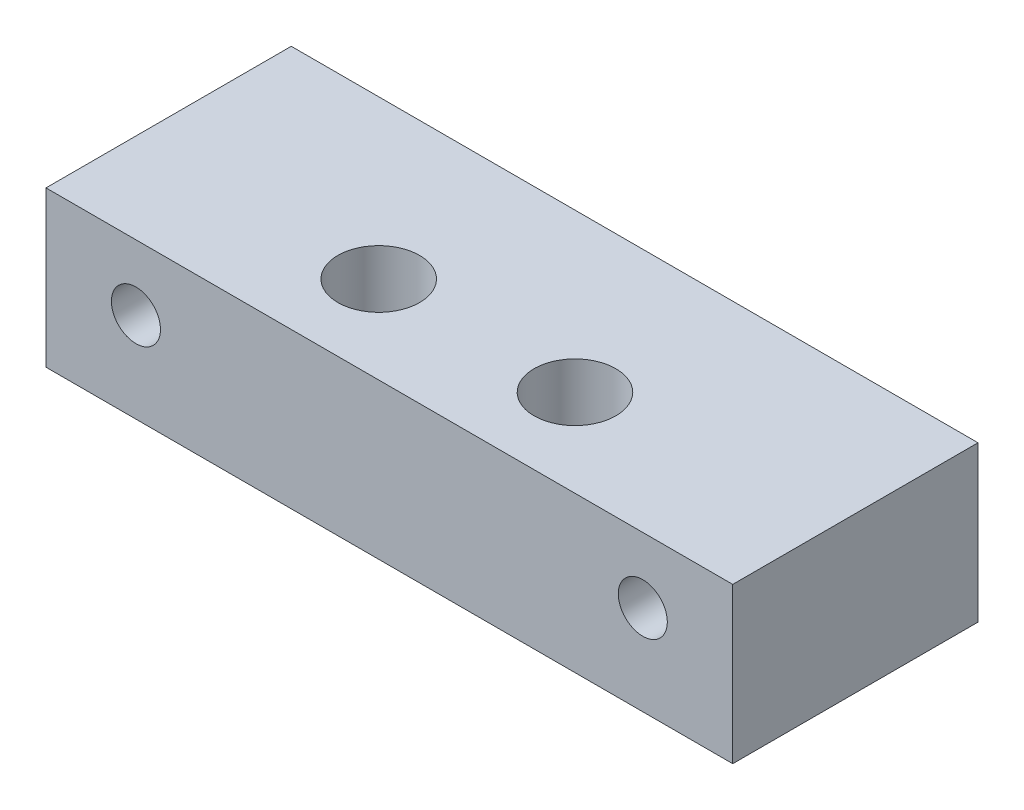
from build123d import *

# Parameters (mm, degrees)
SKETCH1_W           = 42
SKETCH1_H           = 15
BOSS_EXTRUDE1_DEPTH = 9.5
SKETCH2_R           = 2.5
CUT_EXTRUDE1_DEPTH  = 25.238399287
SKETCH3_R           = 1.5
CUT_EXTRUDE2_DEPTH  = 28.5


with BuildPart() as part:
    # Sketch1 → Boss-Extrude1 (new body)
    with BuildSketch(Plane(origin=(0, 0, 0), x_dir=(1, 0, 0), z_dir=(0, 1, 0))):
        Rectangle(SKETCH1_W, SKETCH1_H)
    extrude(amount=BOSS_EXTRUDE1_DEPTH)

    # Sketch2 → Cut-Extrude1 (cut, through all)
    with BuildSketch(Plane(origin=(0, 9.5, 0), x_dir=(1, 0, 0), z_dir=(0, 1, 0))):
        with Locations(Location((-6, -2.15, 0), (0, 0, 270))):
            Circle(SKETCH2_R)
        with Locations(Location((6, -2.15, 0), (0, 0, 270))):
            Circle(SKETCH2_R)
    extrude(amount=-CUT_EXTRUDE1_DEPTH, mode=Mode.SUBTRACT)

    # Sketch3 → Cut-Extrude2 (cut, through all)
    with BuildSketch(Plane.XY.offset(7.5)):
        with Locations((-15.5, 5.5)):
            Circle(SKETCH3_R)
        with Locations((15.5, 5.5)):
            Circle(SKETCH3_R)
    extrude(amount=-CUT_EXTRUDE2_DEPTH, mode=Mode.SUBTRACT)


solid = part.part
